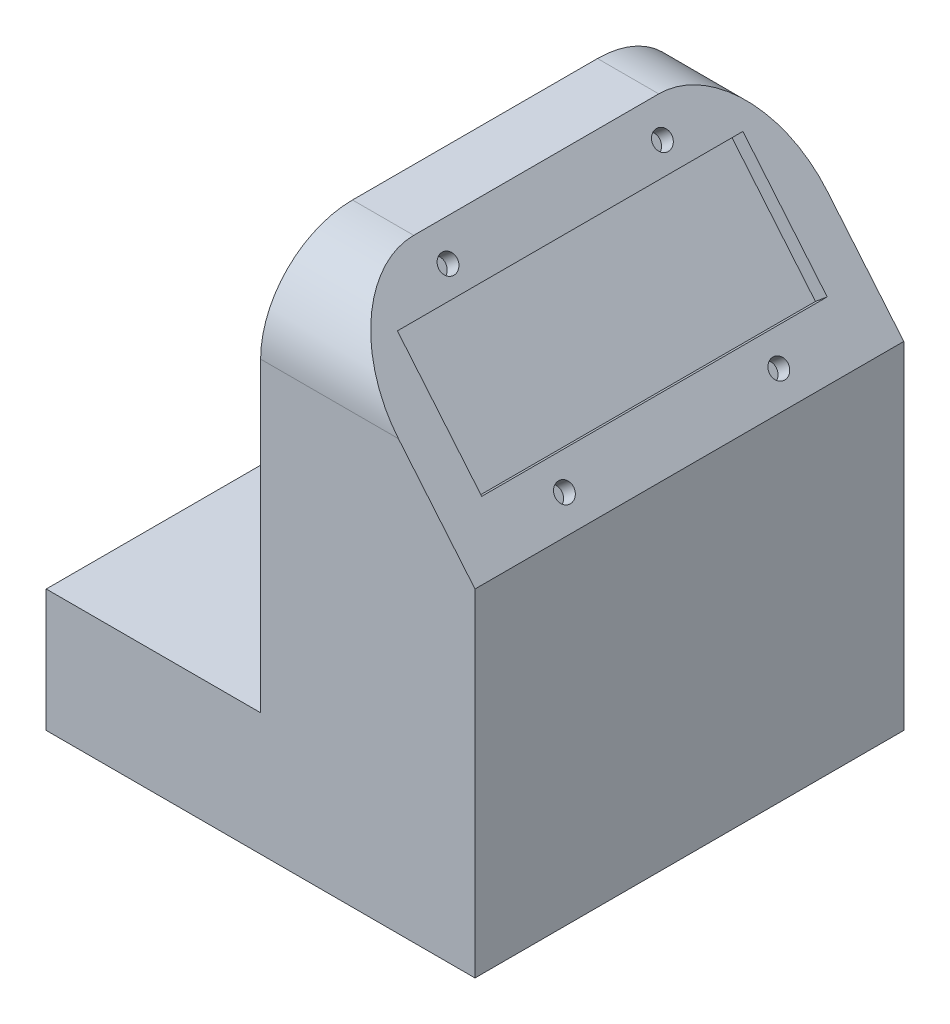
from build123d import *

# Parameters (mm, degrees)
SKETCH1_W           = 88.9
SKETCH1_H           = 88.9
BOSS_EXTRUDE1_DEPTH = 25.4
BOSS_EXTRUDE2_DEPTH = 88.9
SKETCH3_R           = 1.905
SKETCH3_W           = 71.628
SKETCH3_H           = 27.305
CUT_EXTRUDE1_DEPTH  = 3.175
CUT_EXTRUDE2_REACH  = 167.709


with BuildPart() as part:
    # Sketch1 → Boss-Extrude1 (new body)
    with BuildSketch(Plane(origin=(0, 0, 0), x_dir=(1, 0, 0), z_dir=(0, 1, 0))):
        with Locations((44.45, 44.45)):
            Rectangle(SKETCH1_W, SKETCH1_H)
    extrude(amount=BOSS_EXTRUDE1_DEPTH)

    # Sketch2 → Boss-Extrude2 (add)
    with BuildSketch(Plane.XY):
        Polygon((88.9, 25.4), (88.9, 69.85), (57.15, 107.95), (44.45, 107.95), (44.45, 25.4), align=None)
    extrude(amount=-BOSS_EXTRUDE2_DEPTH)

    # Sketch3 → Cut-Extrude1 (cut)
    with BuildSketch(Plane(origin=(86.818032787, 72.348360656, 0), x_dir=(0, 0, -1), z_dir=(0.768221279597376, 0.6401843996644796, 0))):
        with Locations(Location((22.225, 40.201319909, 0), (0, 0, 90))):
            Circle(SKETCH3_R)
        with Locations(Location((22.225, 2.495571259, 0), (0, 0, 90))):
            Circle(SKETCH3_R)
        with Locations(Location((66.675, 40.201319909, 0), (0, 0, 90))):
            Circle(SKETCH3_R)
        with Locations(Location((66.675, 2.495571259, 0), (0, 0, 90))):
            Circle(SKETCH3_R)
        with Locations((44.45, 21.714047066)):
            Rectangle(SKETCH3_W, SKETCH3_H)
    extrude(amount=-CUT_EXTRUDE1_DEPTH, mode=Mode.SUBTRACT)

    # Cut-Extrude2: up to this face of the body (flat: up to its plane)
    cut_extrude2_end = Plane(part.part.faces().sort_by_distance((44.45, 66.675, -44.45))[0])
    # Sketch4 → Cut-Extrude2 (cut, up to the picked face)
    with BuildSketch(Plane(origin=(88.9, 0, 0), x_dir=(0, 0, -1), z_dir=(1, 0, 0)), mode=Mode.PRIVATE) as cut_extrude2_sk1:
        with BuildLine():
            Line((88.9, 25.4), (88.9, 88.9))
            ThreePointArc((88.9, 88.9), (83.320384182, 102.370384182), (69.85, 107.95))
            Line((69.85, 107.95), (19.05, 107.95))
            ThreePointArc((19.05, 107.95), (5.579615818, 102.370384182), (0, 88.9))
            Line((0, 88.9), (0, 25.4))
            Line((0, 25.4), (-34.494832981, 34.925))
            Line((-34.494832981, 34.925), (-19.643171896, 154.082869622))
            Line((-19.643171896, 154.082869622), (144.286350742, 131.627638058))
            Line((144.286350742, 131.627638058), (128.238626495, 34.925))
            Line((128.238626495, 34.925), (88.9, 25.4))
        make_face()
    cut_extrude2_tool1 = split(extrude(cut_extrude2_sk1.sketch, amount=-CUT_EXTRUDE2_REACH, mode=Mode.PRIVATE), bisect_by=cut_extrude2_end, keep=Keep.BOTH, mode=Mode.PRIVATE)
    add(cut_extrude2_tool1.solids().sort_by(Axis((88.9, 57.15, -91.102771), (-1, 0, 0)))[0], mode=Mode.SUBTRACT)


solid = part.part
